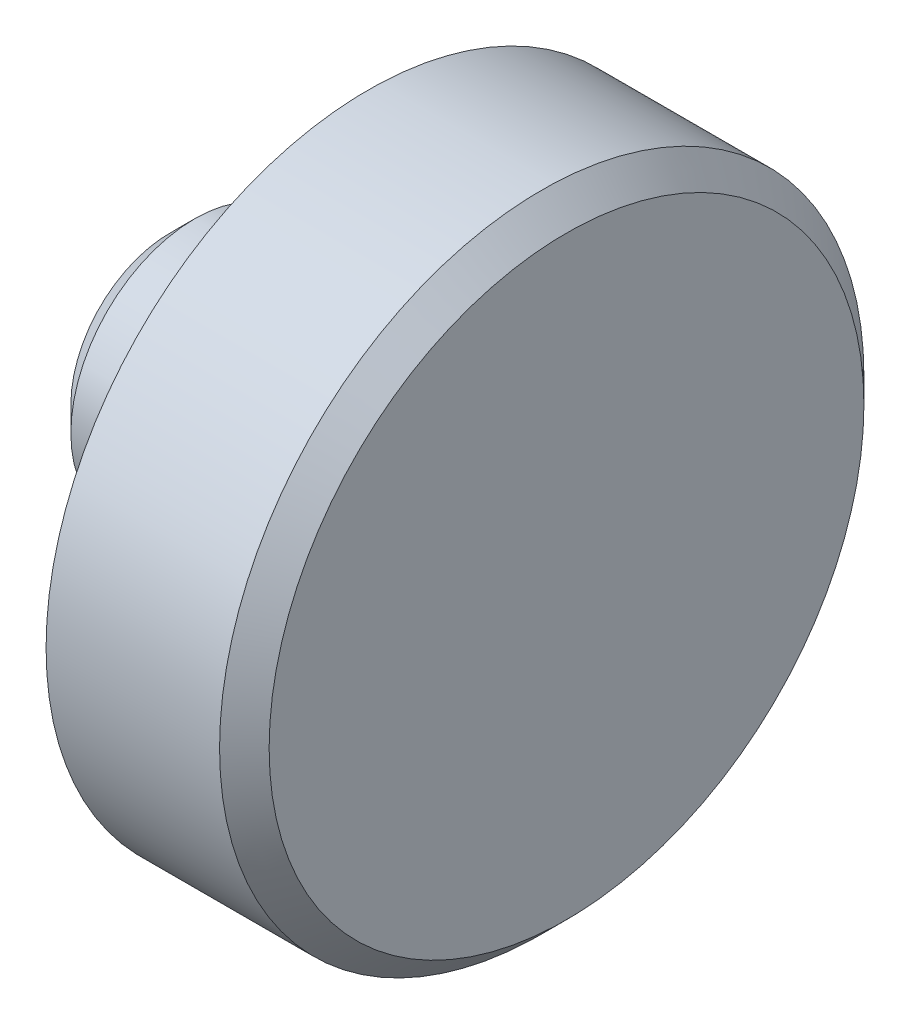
ISO-10303-21;
HEADER;
FILE_DESCRIPTION(('STEP AP214'),'2;1');
FILE_NAME('part.step','',(''),(''),'','','');
FILE_SCHEMA(('AUTOMOTIVE_DESIGN { 1 0 10303 214 1 1 1 1 }'));
ENDSEC;
DATA;
#1=APPLICATION_CONTEXT('core data for automotive mechanical design processes');
#2=APPLICATION_PROTOCOL_DEFINITION('international standard','automotive_design',2000,#1);
#3=PRODUCT_CONTEXT('',#1,'mechanical');
#4=PRODUCT('Part','Part','',(#3));
#5=PRODUCT_RELATED_PRODUCT_CATEGORY('part','',(#4));
#6=PRODUCT_DEFINITION_FORMATION('','',#4);
#7=PRODUCT_DEFINITION_CONTEXT('part definition',#1,'design');
#8=PRODUCT_DEFINITION('design','',#6,#7);
#9=PRODUCT_DEFINITION_SHAPE('','',#8);
#10=(LENGTH_UNIT() NAMED_UNIT(*) SI_UNIT(.MILLI.,.METRE.));
#11=(NAMED_UNIT(*) PLANE_ANGLE_UNIT() SI_UNIT($,.RADIAN.));
#12=(NAMED_UNIT(*) SI_UNIT($,.STERADIAN.) SOLID_ANGLE_UNIT());
#13=UNCERTAINTY_MEASURE_WITH_UNIT(LENGTH_MEASURE(1.E-05),#10,'distance_accuracy_value','');
#14=(GEOMETRIC_REPRESENTATION_CONTEXT(3) GLOBAL_UNCERTAINTY_ASSIGNED_CONTEXT((#13)) GLOBAL_UNIT_ASSIGNED_CONTEXT((#10,
#11,#12)) REPRESENTATION_CONTEXT('',''));
#15=CARTESIAN_POINT('',(0.,0.,0.));
#16=DIRECTION('',(0.,0.,1.));
#17=DIRECTION('',(1.,0.,0.));
#18=AXIS2_PLACEMENT_3D('',#15,#16,#17);
#19=CARTESIAN_POINT('',(0.,0.,0.));
#20=DIRECTION('',(1.,0.,0.));
#21=DIRECTION('',(0.,0.,-1.));
#22=AXIS2_PLACEMENT_3D('',#19,#20,#21);
#23=PLANE('',#22);
#24=CARTESIAN_POINT('',(0.,0.,0.));
#25=DIRECTION('',(1.,0.,0.));
#26=DIRECTION('',(0.,0.,-1.));
#27=AXIS2_PLACEMENT_3D('',#24,#25,#26);
#28=CIRCLE('',#27,6.);
#29=CARTESIAN_POINT('',(0.,0.,-6.));
#30=VERTEX_POINT('',#29);
#31=EDGE_CURVE('E46',#30,#30,#28,.T.);
#32=ORIENTED_EDGE('',*,*,#31,.T.);
#33=EDGE_LOOP('',(#32));
#34=FACE_BOUND('',#33,.T.);
#35=ADVANCED_FACE('F31',(#34),#23,.T.);
#36=CARTESIAN_POINT('',(0.,0.,0.));
#37=DIRECTION('',(1.,0.,0.));
#38=DIRECTION('',(0.,0.,-1.));
#39=AXIS2_PLACEMENT_3D('',#36,#37,#38);
#40=CYLINDRICAL_SURFACE('',#39,6.5);
#41=CARTESIAN_POINT('',(-0.499999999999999,0.,0.));
#42=DIRECTION('',(1.,0.,0.));
#43=DIRECTION('',(0.,0.,-1.));
#44=AXIS2_PLACEMENT_3D('',#41,#42,#43);
#45=CIRCLE('',#44,6.5);
#46=CARTESIAN_POINT('',(-0.499999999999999,0.,-6.5));
#47=VERTEX_POINT('',#46);
#48=EDGE_CURVE('E42',#47,#47,#45,.F.);
#49=ORIENTED_EDGE('',*,*,#48,.T.);
#50=EDGE_LOOP('',(#49));
#51=FACE_BOUND('',#50,.T.);
#52=CARTESIAN_POINT('',(-4.,0.,0.));
#53=DIRECTION('',(1.,0.,0.));
#54=DIRECTION('',(0.,0.,-1.));
#55=AXIS2_PLACEMENT_3D('',#52,#53,#54);
#56=CIRCLE('',#55,6.5);
#57=CARTESIAN_POINT('',(-4.,0.,-6.5));
#58=VERTEX_POINT('',#57);
#59=EDGE_CURVE('E51',#58,#58,#56,.T.);
#60=ORIENTED_EDGE('',*,*,#59,.T.);
#61=EDGE_LOOP('',(#60));
#62=FACE_BOUND('',#61,.T.);
#63=ADVANCED_FACE('F71',(#51,#62),#40,.T.);
#64=CARTESIAN_POINT('',(-4.,6.5,0.));
#65=DIRECTION('',(-1.,0.,0.));
#66=DIRECTION('',(0.,0.,1.));
#67=AXIS2_PLACEMENT_3D('',#64,#65,#66);
#68=PLANE('',#67);
#69=CARTESIAN_POINT('',(-4.,0.,0.));
#70=DIRECTION('',(1.,0.,0.));
#71=DIRECTION('',(0.,0.,-1.));
#72=AXIS2_PLACEMENT_3D('',#69,#70,#71);
#73=CIRCLE('',#72,2.5);
#74=CARTESIAN_POINT('',(-4.,0.,-2.5));
#75=VERTEX_POINT('',#74);
#76=EDGE_CURVE('E54',#75,#75,#73,.T.);
#77=ORIENTED_EDGE('',*,*,#76,.T.);
#78=EDGE_LOOP('',(#77));
#79=FACE_BOUND('',#78,.T.);
#80=ORIENTED_EDGE('',*,*,#59,.F.);
#81=EDGE_LOOP('',(#80));
#82=FACE_BOUND('',#81,.T.);
#83=ADVANCED_FACE('F58',(#79,#82),#68,.T.);
#84=CARTESIAN_POINT('',(0.,0.,0.));
#85=DIRECTION('',(1.,0.,0.));
#86=DIRECTION('',(0.,0.,-1.));
#87=AXIS2_PLACEMENT_3D('',#84,#85,#86);
#88=CYLINDRICAL_SURFACE('',#87,2.5);
#89=CARTESIAN_POINT('',(-7.5,0.,0.));
#90=DIRECTION('',(-1.,0.,0.));
#91=DIRECTION('',(0.,0.,1.));
#92=AXIS2_PLACEMENT_3D('',#89,#90,#91);
#93=CIRCLE('',#92,2.5);
#94=CARTESIAN_POINT('',(-7.5,0.,2.5));
#95=VERTEX_POINT('',#94);
#96=EDGE_CURVE('E38',#95,#95,#93,.F.);
#97=ORIENTED_EDGE('',*,*,#96,.T.);
#98=EDGE_LOOP('',(#97));
#99=FACE_BOUND('',#98,.T.);
#100=ORIENTED_EDGE('',*,*,#76,.F.);
#101=EDGE_LOOP('',(#100));
#102=FACE_BOUND('',#101,.T.);
#103=ADVANCED_FACE('F61',(#99,#102),#88,.T.);
#104=CARTESIAN_POINT('',(-8.,2.5,0.));
#105=DIRECTION('',(-1.,0.,0.));
#106=DIRECTION('',(0.,0.,1.));
#107=AXIS2_PLACEMENT_3D('',#104,#105,#106);
#108=PLANE('',#107);
#109=CARTESIAN_POINT('',(-8.,0.,0.));
#110=DIRECTION('',(-1.,0.,0.));
#111=DIRECTION('',(0.,0.,1.));
#112=AXIS2_PLACEMENT_3D('',#109,#110,#111);
#113=CIRCLE('',#112,2.);
#114=CARTESIAN_POINT('',(-8.,0.,2.));
#115=VERTEX_POINT('',#114);
#116=EDGE_CURVE('E10',#115,#115,#113,.T.);
#117=ORIENTED_EDGE('',*,*,#116,.T.);
#118=EDGE_LOOP('',(#117));
#119=FACE_BOUND('',#118,.T.);
#120=ADVANCED_FACE('F63',(#119),#108,.T.);
#121=CARTESIAN_POINT('',(0.,0.,0.));
#122=DIRECTION('',(-1.,0.,0.));
#123=DIRECTION('',(0.,0.,1.));
#124=AXIS2_PLACEMENT_3D('',#121,#122,#123);
#125=CONICAL_SURFACE('',#124,6.,0.785398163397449);
#126=ORIENTED_EDGE('',*,*,#48,.F.);
#127=EDGE_LOOP('',(#126));
#128=FACE_BOUND('',#127,.T.);
#129=ORIENTED_EDGE('',*,*,#31,.F.);
#130=EDGE_LOOP('',(#129));
#131=FACE_BOUND('',#130,.T.);
#132=ADVANCED_FACE('F69',(#128,#131),#125,.T.);
#133=CARTESIAN_POINT('',(-7.5,0.,0.));
#134=DIRECTION('',(1.,0.,0.));
#135=DIRECTION('',(0.,0.,-1.));
#136=AXIS2_PLACEMENT_3D('',#133,#134,#135);
#137=CONICAL_SURFACE('',#136,2.5,0.785398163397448);
#138=ORIENTED_EDGE('',*,*,#116,.F.);
#139=EDGE_LOOP('',(#138));
#140=FACE_BOUND('',#139,.T.);
#141=ORIENTED_EDGE('',*,*,#96,.F.);
#142=EDGE_LOOP('',(#141));
#143=FACE_BOUND('',#142,.T.);
#144=ADVANCED_FACE('F33',(#140,#143),#137,.T.);
#145=CLOSED_SHELL('',(#35,#63,#83,#103,#120,#132,#144));
#146=MANIFOLD_SOLID_BREP('B2',#145);
#147=ADVANCED_BREP_SHAPE_REPRESENTATION('',(#18,#146),#14);
#148=SHAPE_DEFINITION_REPRESENTATION(#9,#147);
ENDSEC;
END-ISO-10303-21;
